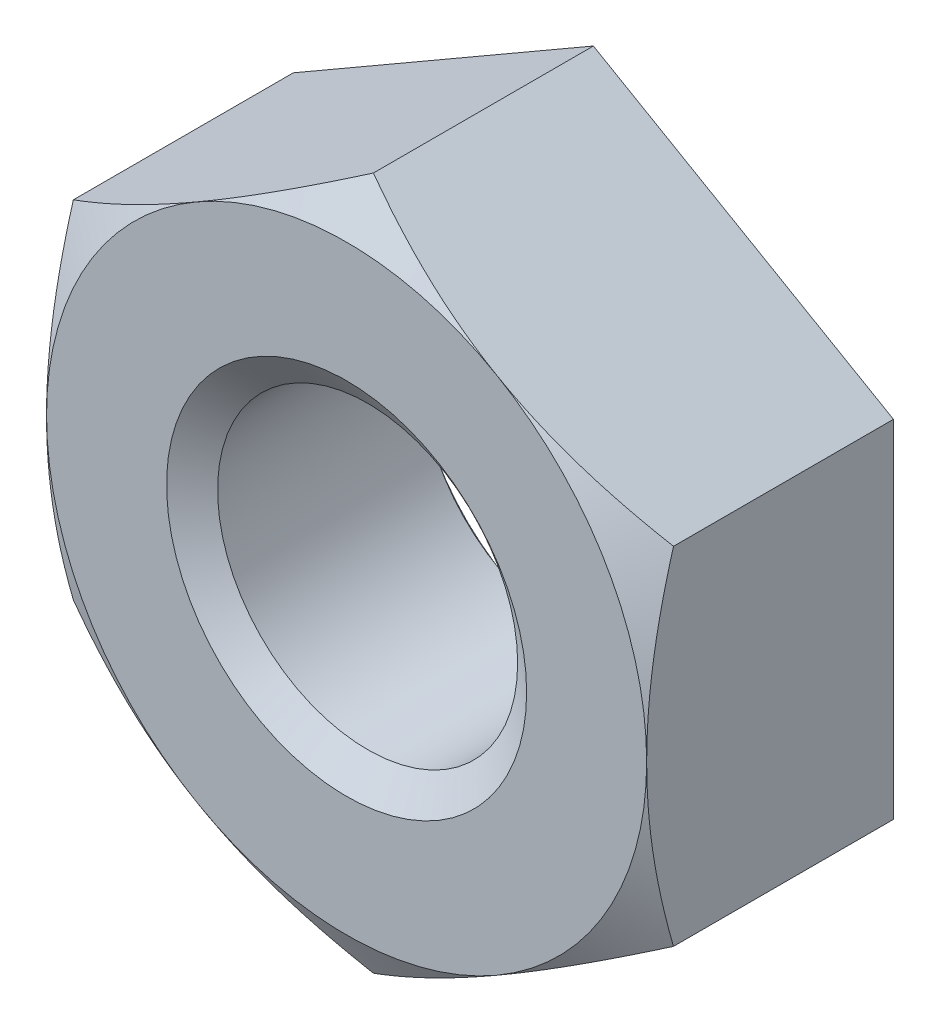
from build123d import *

# Parameters (mm, degrees)
BASENUT_START = -6.5278
BASENUTSKE_R  = 3.96875
BASENUT_DEPTH = 6.5278


with BuildPart() as part:
    # BaseNutSke → BaseNut (new body)
    with BuildSketch(Plane.XY.offset(BASENUT_START)):
        Polygon((7.9375, 4.582717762), (7.9375, -4.582717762), (0, -9.165435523), (-7.9375, -4.582717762), (-7.9375, 4.582717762), (0, 9.165435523), align=None)
        Circle(BASENUTSKE_R, mode=Mode.SUBTRACT)
    extrude(amount=BASENUT_DEPTH)

    # Sketch4 → Single-Chamfer (revolve, cut)
    with BuildSketch(Plane(origin=(0, 0, 0), x_dir=(0, 0, -1), z_dir=(1, 0, 0))):
        Polygon((0, 7.9375), (-12.7, 7.9375), (-12.7, 21.865435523), (0.708948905, 21.865435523), (0.708948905, 9.165435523), align=None)
    revolve(axis=Axis((0, 0, 0), (0, 0, -1)), mode=Mode.SUBTRACT)

    # EndChamferSketch → EndChamfer (revolve, cut)
    with BuildSketch(Plane(origin=(0, 0, 0), x_dir=(0, 0, -1), z_dir=(1, 0, 0)), mode=Mode.PRIVATE) as endchamfer_sk:
        Polygon((6.5024, 4.7625), (5.891031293, 3.889375), (6.5532, 3.889375), (6.5532, 4.7625), align=None)
        Polygon((-0.0508, 4.7625), (0, 4.7625), (0.611368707, 3.889375), (-0.0508, 3.889375), align=None)
    revolve(endchamfer_sk.sketch.rotate(Axis((0, 0, -25.037505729), (0, 0, -1)), 90), axis=Axis((0, 0, -25.037505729), (0, 0, -1)), mode=Mode.SUBTRACT)


solid = part.part
